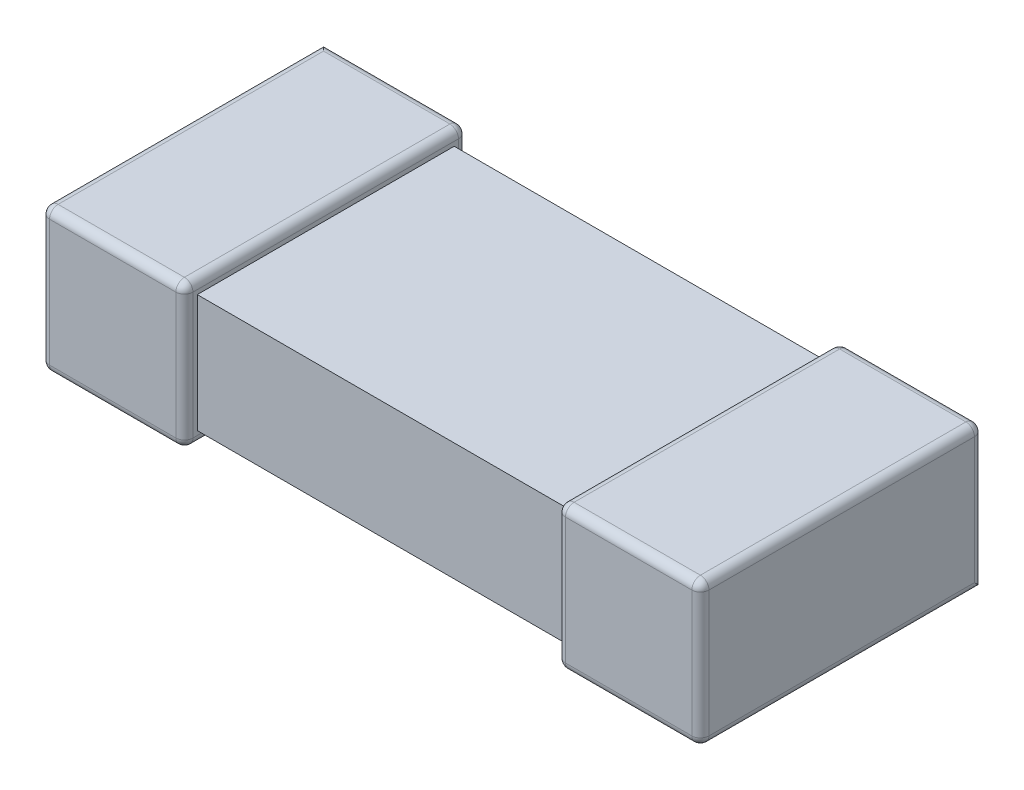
from build123d import *

# Parameters (mm, degrees)
SKETCH1_W           = 2.2098
SKETCH1_H           = 1.524
BOSS_EXTRUDE1_DEPTH = 0.6985
SKETCH3_W           = 1.6764
SKETCH3_H           = 0.8509
BOSS_EXTRUDE2_DEPTH = 0.8509
SKETCH4_W           = 1.6764
SKETCH4_H           = 0.8509
BOSS_EXTRUDE3_DEPTH = 0.8509
FILLET1_R           = 0.0508
FILLET2_R           = 0.0508


with BuildPart() as part:
    # Sketch1 → Boss-Extrude1 (new body)
    with BuildSketch(Plane(origin=(0, 0, 0), x_dir=(1, 0, 0), z_dir=(0, 1, 0))):
        Rectangle(SKETCH1_W, SKETCH1_H)
    extrude(amount=BOSS_EXTRUDE1_DEPTH)

    # Sketch3 → Boss-Extrude2 (add)
    with BuildSketch(Plane.ZY.offset(1.1049)):
        with Locations((0, 0.34925)):
            Rectangle(SKETCH3_W, SKETCH3_H)
    extrude(amount=BOSS_EXTRUDE2_DEPTH)

    # Sketch4 → Boss-Extrude3 (add)
    with BuildSketch(Plane(origin=(1.1049, 0, 0), x_dir=(0, 0, -1), z_dir=(1, 0, 0))):
        with Locations((0, 0.34925)):
            Rectangle(SKETCH4_W, SKETCH4_H)
    extrude(amount=BOSS_EXTRUDE3_DEPTH)

    # Fillet1
    fillet1_edges = [part.edges().sort_by_distance(p)[0] for p in [
        (-1.1049, 0.34925, 0.8382),
        (-1.53035, -0.0762, 0.8382),
        (-1.1049, 0.7747, 0),
        (-1.53035, 0.7747, 0.8382),
        (-1.1049, 0.34925, -0.8382),
        (-1.53035, 0.7747, -0.8382),
        (-1.1049, -0.0762, 0),
        (-1.53035, -0.0762, -0.8382),
        (-1.9558, 0.34925, 0.8382),
        (-1.9558, 0.7747, 0),
        (-1.9558, -0.0762, 0),
    ]]
    fillet(fillet1_edges, radius=FILLET1_R)

    # Fillet2
    fillet2_edges = [part.edges().sort_by_distance(p)[0] for p in [
        (1.1049, 0.34925, -0.8382),
        (1.1049, 0.7747, 0),
        (1.53035, 0.7747, -0.8382),
        (1.1049, 0.34925, 0.8382),
        (1.53035, 0.7747, 0.8382),
        (1.1049, -0.0762, 0),
        (1.53035, -0.0762, 0.8382),
        (1.9558, 0.34925, -0.8382),
        (1.9558, 0.7747, 0),
        (1.9558, 0.34925, 0.8382),
        (1.9558, -0.0762, 0),
    ]]
    fillet(fillet2_edges, radius=FILLET2_R)


solid = part.part
